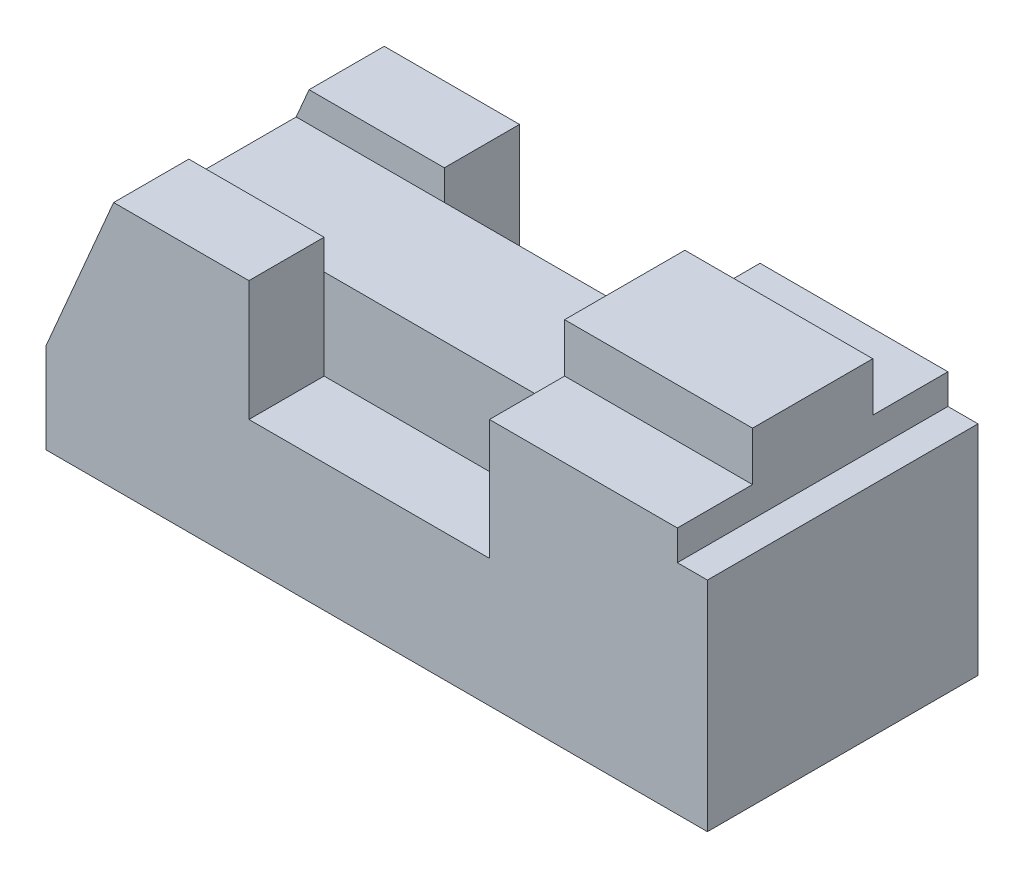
from build123d import *

# Parameters (mm, degrees)
EXTRUDE_1_DEPTH      = 72
EXTRUDE_1_DEPTH_BACK = 72
SKETCH_2_W           = 128
SKETCH_2_H           = 48
CUT_EXTRUDE_1_DEPTH  = 40
SKETCH_3_W           = 64
SKETCH_3_H           = 16
CUT_EXTRUDE_3_DEPTH  = 179.226102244
SKETCH_4_W           = 100
SKETCH_4_H           = 64
EXTRUDE_2_DEPTH      = 26


with BuildPart() as part:
    # Sketch 1 → Extrude 1 (new, two sides: drawn at the far end of the back side and taken through both)
    with BuildSketch(Plane.XY.offset(-EXTRUDE_1_DEPTH_BACK)):
        Polygon((0, 0), (0, 48), (36, 132), (108, 132), (108, 116), (236, 116), (236, 132), (336, 132), (336, 116), (352, 116), (352, 0), align=None)
    extrude(amount=EXTRUDE_1_DEPTH + EXTRUDE_1_DEPTH_BACK)

    # Sketch 2 → Cut-Extrude 1 (cut)
    with BuildSketch(Plane.XY.offset(72)):
        with Locations((172, 92)):
            Rectangle(SKETCH_2_W, SKETCH_2_H)
    cut_extrude_1 = extrude(amount=-CUT_EXTRUDE_1_DEPTH, mode=Mode.SUBTRACT)

    # Sketch 3 → Cut-Extrude 3 (cut)
    with BuildSketch(Plane.ZY):
        with Locations((0, 124)):
            Rectangle(SKETCH_3_W, SKETCH_3_H)
    extrude(amount=-CUT_EXTRUDE_3_DEPTH, mode=Mode.SUBTRACT)

    # Sketch 4 → Extrude 2 (add)
    with BuildSketch(Plane(origin=(0, 132, 0), x_dir=(1, 0, 0), z_dir=(0, 1, 0))):
        with Locations((286, 0)):
            Rectangle(SKETCH_4_W, SKETCH_4_H)
    extrude(amount=EXTRUDE_2_DEPTH)

    # Mirror 1: Cut-Extrude 1 across plane
    add(cut_extrude_1.mirror(Plane.XY), mode=Mode.SUBTRACT)


solid = part.part
